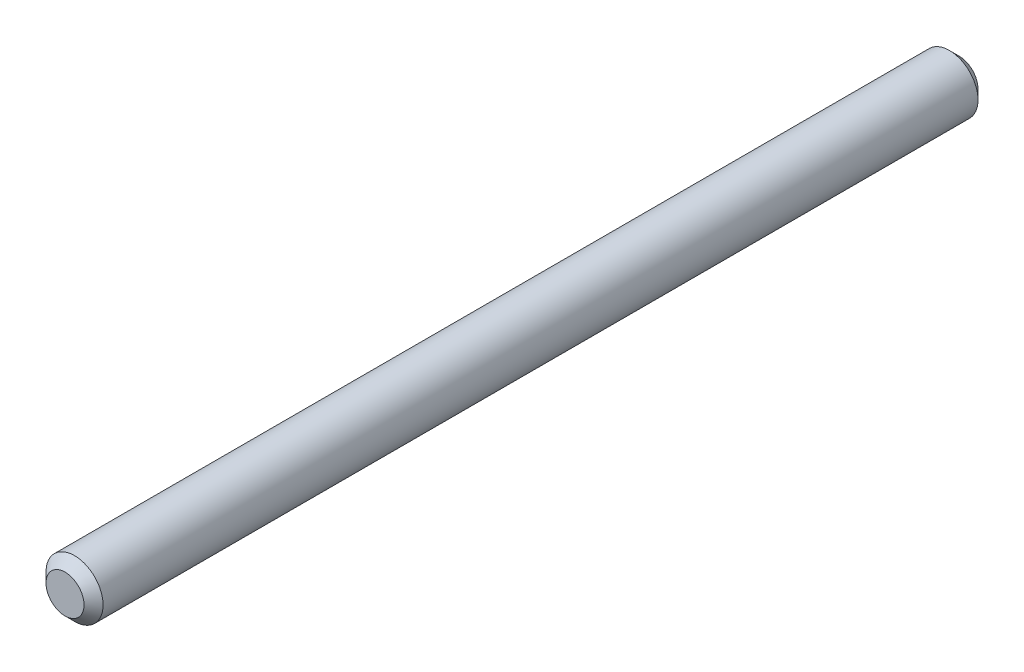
from build123d import *

# Parameters (mm, degrees)
ESQUISSE1_R          = 1.5
BASE_EXTRUSION_DEPTH = 47
CHANFREIN1_SIZE      = 0.5


with BuildPart() as part:
    # Esquisse1 → Base-Extrusion (new body)
    with BuildSketch(Plane.XY):
        Circle(ESQUISSE1_R)
    extrude(amount=BASE_EXTRUSION_DEPTH)

    # Chanfrein1
    chanfrein1_edges = [part.edges().sort_by_distance(p)[0] for p in [
        (-1.5, 0, 0),
        (-1.5, 0, 47),
    ]]
    chamfer(chanfrein1_edges, length=CHANFREIN1_SIZE)


solid = part.part
